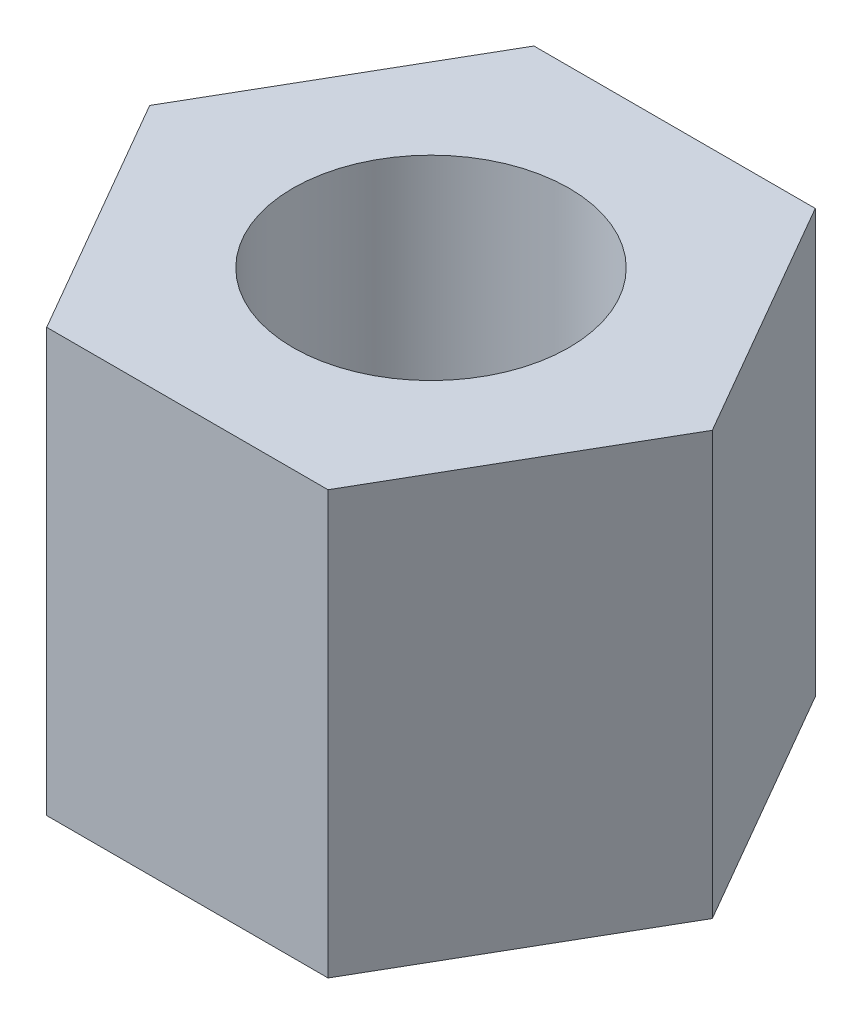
from build123d import *

# Parameters (mm, degrees)
EXTRUDE1_DEPTH         = 10.414
M8X1_25_TAPPED_HOLE1_D = 6.8


with BuildPart() as part:
    # Sketch1 → Extrude1 (new body)
    with BuildSketch(Plane(origin=(0, 0, 0), x_dir=(1, 0, 0), z_dir=(0, 1, 0))):
        Polygon((3.464101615, 6), (-3.464101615, 6), (-6.92820323, 0), (-3.464101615, -6), (3.464101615, -6), (6.92820323, 0), align=None)
    extrude(amount=EXTRUDE1_DEPTH)

    # M8x1.25 Tapped Hole1 (through all)
    with Locations(Plane(origin=(0, 10.414, 0), x_dir=(-1, 0, 0), z_dir=(0, 1, 0))):
        with Locations((0, 0)):
            Hole(M8X1_25_TAPPED_HOLE1_D / 2)


solid = part.part
